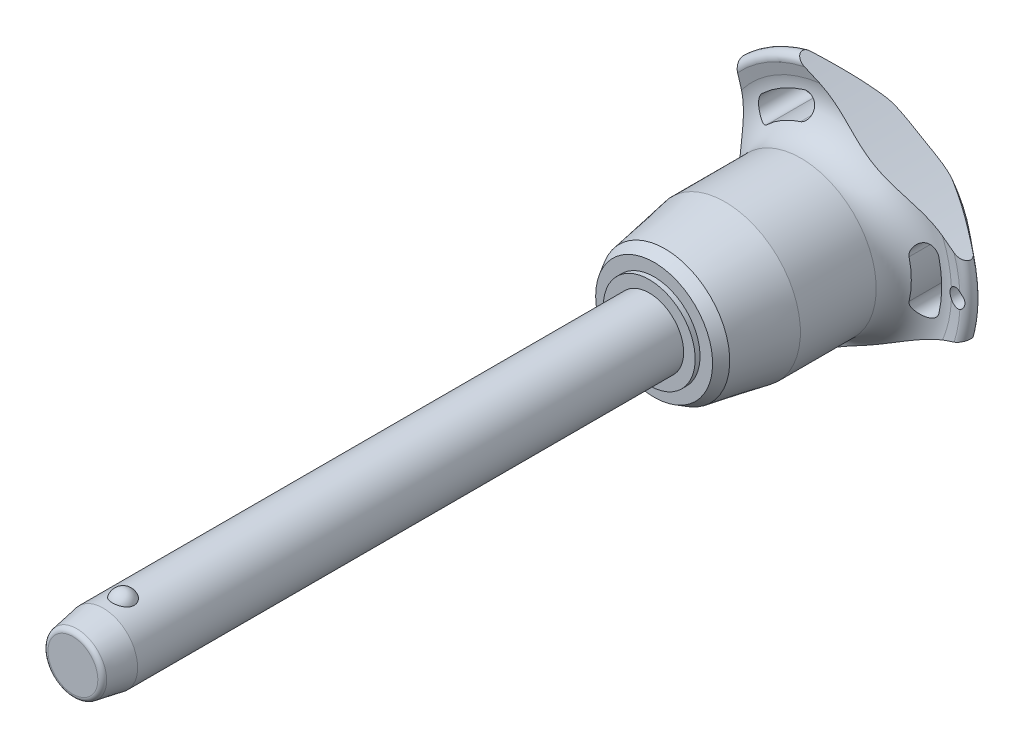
from build123d import *

# Parameters (mm, degrees)
SKETCH1_R           = 6
BOSS_EXTRUDE1_DEPTH = 90
SKETCH2_R           = 5.15
BOSS_EXTRUDE2_DEPTH = 39.7
BOSS_EXTRUDE3_START = 10.6
SKETCH1_2_R         = 6
BOSS_EXTRUDE3_DEPTH = 10.6
CHAMFER1_SIZE       = 5.3
CHAMFER1_SIZE2      = 0.934532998
FILLET1_R           = 0.85
SKETCH6_R           = 144.275
CUT_EXTRUDE1_DEPTH  = 134.999042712
CIRPATTERN1_COUNT   = 3
SKETCH7_R           = 1.5
CUT_EXTRUDE2_DEPTH  = 134.849189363


with BuildPart() as part:
    # Sketch1 → Boss-Extrude1 (new body)
    with BuildSketch(Plane.XY):
        Circle(SKETCH1_R)
    extrude(amount=-BOSS_EXTRUDE1_DEPTH)

    # Sketch2 → Boss-Extrude2 (add)
    with BuildSketch(Plane(origin=(0, 0, -90), x_dir=(-1, 0, 0), z_dir=(0, 0, -1))):
        Circle(SKETCH2_R)
    extrude(amount=BOSS_EXTRUDE2_DEPTH)

    # Sketch3 → Revolve1 (revolve)
    with BuildSketch(Plane(origin=(0, 0, 0), x_dir=(0, 0, -1), z_dir=(1, 0, 0))):
        with BuildLine():
            Line((-1.854049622, 7.25), (-1.854049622, 3.25))
            ThreePointArc((-1.854049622, 3.25), (0.145950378, 5.25), (-1.854049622, 7.25))
        make_face()
        with BuildLine():
            Line((-1.854049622, -3.25), (-1.854049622, -7.25))
            ThreePointArc((-1.854049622, -7.25), (0.145950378, -5.25), (-1.854049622, -3.25))
        make_face()
    revolve(axis=Axis((0, -3.25, 1.854049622), (0, 1, 0)))

    # Sketch1_2 → Boss-Extrude3 (add)
    with BuildSketch(Plane.XY.offset(BOSS_EXTRUDE3_START)):
        Circle(SKETCH1_2_R)
    extrude(amount=-BOSS_EXTRUDE3_DEPTH)

    # Chamfer1
    chamfer1_edges = [part.edges().sort_by_distance(p)[0] for p in [
        (-6, 0, 10.6),
    ]]
    chamfer1_side = [part.faces().sort_by_distance(p)[0] for p in [
        (-6, 0, -39.7),
    ]]
    chamfer(chamfer1_edges, length=CHAMFER1_SIZE, length2=CHAMFER1_SIZE2, reference=chamfer1_side[0])

    # Fillet1
    fillet1_edges = [part.edges().sort_by_distance(p)[0] for p in [
        (-5.065467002, 0, 10.6),
        (5.15, 0, -129.7),
    ]]
    fillet(fillet1_edges, radius=FILLET1_R)

    # Sketch4 → Revolve2 (revolve)
    with BuildSketch(Plane(origin=(0, 0, 0), x_dir=(0, 0, -1), z_dir=(1, 0, 0)), mode=Mode.PRIVATE) as revolve2_sk:
        Polygon((90, 0), (90, 8.017240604), (90.85, 8.017240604), (90.85, 10.206249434), (92.745737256, 11.300753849), (103.233333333, 13.15), (116.466666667, 13.15), (116.466666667, 0), align=None)
    revolve(revolve2_sk.sketch.rotate(Axis((0, 0, -116.466666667), (0, 0, 1)), 90), axis=Axis((0, 0, -116.466666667), (0, 0, 1)))

    # Sketch5 → Revolve3 (revolve)
    with BuildSketch(Plane(origin=(0, 0, 0), x_dir=(0, 0, -1), z_dir=(1, 0, 0)), mode=Mode.PRIVATE) as revolve3_sk:
        with BuildLine():
            Line((122.32877039, 20.428960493), (121.910912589, 22.344207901))
            ThreePointArc((121.910912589, 22.344207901), (122.554394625, 23.677136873), (124.002586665, 23.371345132))
            Line((124.002586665, 23.371345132), (129.141488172, 17.247040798))
            ThreePointArc((129.141488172, 17.247040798), (129.7, 15.584758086), (128.978803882, 13.986322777))
            ThreePointArc((128.978803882, 13.986322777), (124.617427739, 7.589034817), (123.083333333, 0))
            Line((123.083333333, 0), (116.466666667, 0))
            Line((116.466666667, 0), (116.466666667, 13.15))
            ThreePointArc((116.466666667, 13.15), (121.139661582, 15.38660811), (122.32877039, 20.428960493))
        make_face()
    revolve(revolve3_sk.sketch.rotate(Axis((0, 0, -123.083333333), (0, 0, 1)), 90), axis=Axis((0, 0, -123.083333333), (0, 0, 1)))

    # Sketch6 → Cut-Extrude1 (cut, through all)
    with BuildSketch(Plane.XY):
        with Locations((-159.975, 0)):
            Circle(SKETCH6_R)
        with BuildLine():
            ThreePointArc((18.131206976, -4.190753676), (18.60922037, 0), (18.131206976, 4.190753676))
            ThreePointArc((18.131206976, 4.190753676), (15.94840906, 5.553949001), (14.585213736, 3.371151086))
            ThreePointArc((14.585213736, 3.371151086), (14.969740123, 0), (14.585213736, -3.371151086))
            ThreePointArc((14.585213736, -3.371151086), (15.94840906, -5.553949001), (18.131206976, -4.190753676))
        make_face()
    cut_extrude1 = extrude(amount=-CUT_EXTRUDE1_DEPTH, mode=Mode.SUBTRACT)

    # CirPattern1: Cut-Extrude1 ×3 about axis
    cirpattern1_axis = Axis((0, 0, 0), (0, 0, 1))
    for i in range(1, CIRPATTERN1_COUNT):
        add(cut_extrude1.rotate(cirpattern1_axis, i * 360 / CIRPATTERN1_COUNT), mode=Mode.SUBTRACT)

    # Sketch7 → Cut-Extrude2 (cut, through all)
    with BuildSketch(Plane.XY):
        with Locations(Location((21.60922037, 0, 0), (0, 0, 297.620773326))):
            Circle(SKETCH7_R)
    extrude(amount=-CUT_EXTRUDE2_DEPTH, mode=Mode.SUBTRACT)


solid = part.part
